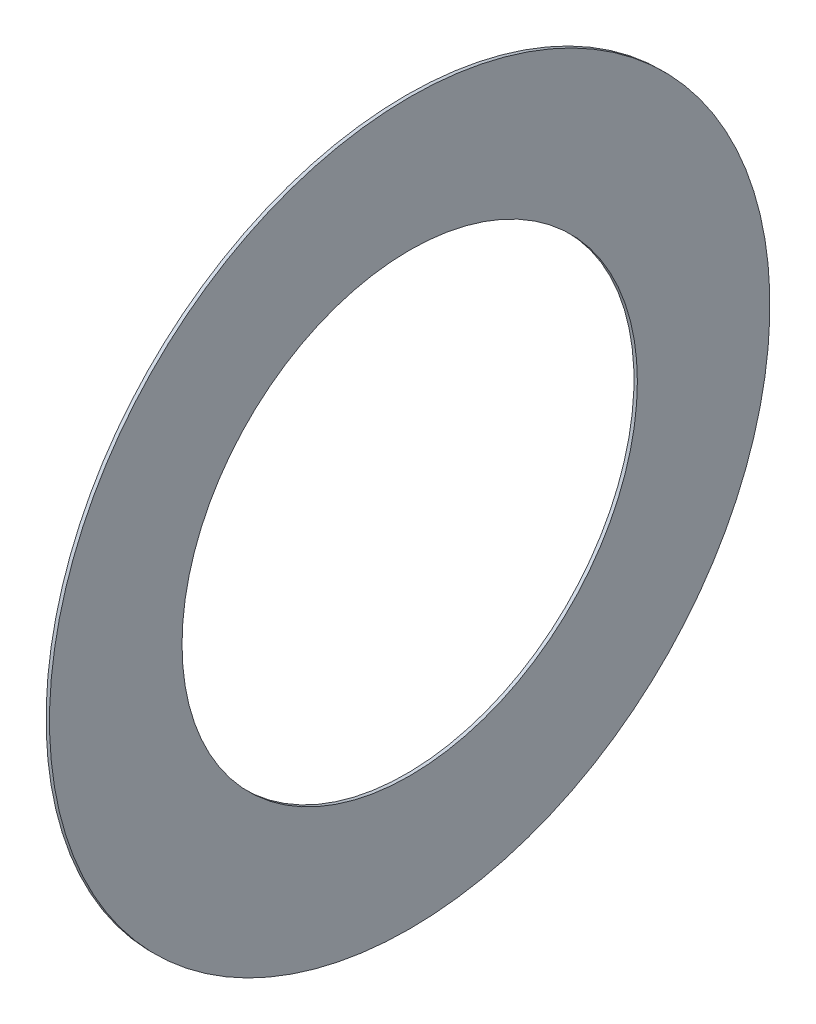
ISO-10303-21;
HEADER;
FILE_DESCRIPTION(('STEP AP214'),'2;1');
FILE_NAME('part.step','',(''),(''),'','','');
FILE_SCHEMA(('AUTOMOTIVE_DESIGN { 1 0 10303 214 1 1 1 1 }'));
ENDSEC;
DATA;
#1=APPLICATION_CONTEXT('core data for automotive mechanical design processes');
#2=APPLICATION_PROTOCOL_DEFINITION('international standard','automotive_design',2000,#1);
#3=PRODUCT_CONTEXT('',#1,'mechanical');
#4=PRODUCT('Part','Part','',(#3));
#5=PRODUCT_RELATED_PRODUCT_CATEGORY('part','',(#4));
#6=PRODUCT_DEFINITION_FORMATION('','',#4);
#7=PRODUCT_DEFINITION_CONTEXT('part definition',#1,'design');
#8=PRODUCT_DEFINITION('design','',#6,#7);
#9=PRODUCT_DEFINITION_SHAPE('','',#8);
#10=(LENGTH_UNIT() NAMED_UNIT(*) SI_UNIT(.MILLI.,.METRE.));
#11=(NAMED_UNIT(*) PLANE_ANGLE_UNIT() SI_UNIT($,.RADIAN.));
#12=(NAMED_UNIT(*) SI_UNIT($,.STERADIAN.) SOLID_ANGLE_UNIT());
#13=UNCERTAINTY_MEASURE_WITH_UNIT(LENGTH_MEASURE(1.E-05),#10,'distance_accuracy_value','');
#14=(GEOMETRIC_REPRESENTATION_CONTEXT(3) GLOBAL_UNCERTAINTY_ASSIGNED_CONTEXT((#13)) GLOBAL_UNIT_ASSIGNED_CONTEXT((#10,
#11,#12)) REPRESENTATION_CONTEXT('',''));
#15=CARTESIAN_POINT('',(0.,0.,0.));
#16=DIRECTION('',(0.,0.,1.));
#17=DIRECTION('',(1.,0.,0.));
#18=AXIS2_PLACEMENT_3D('',#15,#16,#17);
#19=CARTESIAN_POINT('',(4.85,0.,0.));
#20=DIRECTION('',(-1.,0.,0.));
#21=DIRECTION('',(0.,0.,1.));
#22=AXIS2_PLACEMENT_3D('',#19,#20,#21);
#23=PLANE('',#22);
#24=CARTESIAN_POINT('',(4.85,0.,0.));
#25=DIRECTION('',(-1.,0.,0.));
#26=DIRECTION('',(0.,0.,1.));
#27=AXIS2_PLACEMENT_3D('',#24,#25,#26);
#28=CIRCLE('',#27,10.05);
#29=CARTESIAN_POINT('',(4.85,0.,10.05));
#30=VERTEX_POINT('',#29);
#31=EDGE_CURVE('E31',#30,#30,#28,.T.);
#32=ORIENTED_EDGE('',*,*,#31,.F.);
#33=EDGE_LOOP('',(#32));
#34=FACE_BOUND('',#33,.T.);
#35=CARTESIAN_POINT('',(4.85,0.,0.));
#36=DIRECTION('',(1.,0.,0.));
#37=DIRECTION('',(0.,-1.,0.));
#38=AXIS2_PLACEMENT_3D('',#35,#36,#37);
#39=CIRCLE('',#38,15.9);
#40=CARTESIAN_POINT('',(4.85,-15.9,0.));
#41=VERTEX_POINT('',#40);
#42=EDGE_CURVE('E9',#41,#41,#39,.T.);
#43=ORIENTED_EDGE('',*,*,#42,.F.);
#44=EDGE_LOOP('',(#43));
#45=FACE_BOUND('',#44,.T.);
#46=ADVANCED_FACE('F13',(#34,#45),#23,.T.);
#47=CARTESIAN_POINT('',(5.,0.,0.));
#48=DIRECTION('',(1.,0.,0.));
#49=DIRECTION('',(0.,0.,-1.));
#50=AXIS2_PLACEMENT_3D('',#47,#48,#49);
#51=PLANE('',#50);
#52=CARTESIAN_POINT('',(5.,0.,0.));
#53=DIRECTION('',(1.,0.,0.));
#54=DIRECTION('',(0.,0.,-1.));
#55=AXIS2_PLACEMENT_3D('',#52,#53,#54);
#56=CIRCLE('',#55,10.05);
#57=CARTESIAN_POINT('',(5.,0.,-10.05));
#58=VERTEX_POINT('',#57);
#59=EDGE_CURVE('E17',#58,#58,#56,.T.);
#60=ORIENTED_EDGE('',*,*,#59,.F.);
#61=EDGE_LOOP('',(#60));
#62=FACE_BOUND('',#61,.T.);
#63=CARTESIAN_POINT('',(5.,0.,0.));
#64=DIRECTION('',(-1.,0.,0.));
#65=DIRECTION('',(0.,-1.,0.));
#66=AXIS2_PLACEMENT_3D('',#63,#64,#65);
#67=CIRCLE('',#66,15.9);
#68=CARTESIAN_POINT('',(5.,-15.9,0.));
#69=VERTEX_POINT('',#68);
#70=EDGE_CURVE('E22',#69,#69,#67,.T.);
#71=ORIENTED_EDGE('',*,*,#70,.F.);
#72=EDGE_LOOP('',(#71));
#73=FACE_BOUND('',#72,.T.);
#74=ADVANCED_FACE('F46',(#62,#73),#51,.T.);
#75=CARTESIAN_POINT('',(5.,0.,0.));
#76=DIRECTION('',(-1.,0.,0.));
#77=DIRECTION('',(0.,-1.,0.));
#78=AXIS2_PLACEMENT_3D('',#75,#76,#77);
#79=CYLINDRICAL_SURFACE('',#78,15.9);
#80=ORIENTED_EDGE('',*,*,#42,.T.);
#81=EDGE_LOOP('',(#80));
#82=FACE_BOUND('',#81,.T.);
#83=ORIENTED_EDGE('',*,*,#70,.T.);
#84=EDGE_LOOP('',(#83));
#85=FACE_BOUND('',#84,.T.);
#86=ADVANCED_FACE('F15',(#82,#85),#79,.T.);
#87=CARTESIAN_POINT('',(6.,0.,0.));
#88=DIRECTION('',(-1.,0.,0.));
#89=DIRECTION('',(0.,-1.,0.));
#90=AXIS2_PLACEMENT_3D('',#87,#88,#89);
#91=CYLINDRICAL_SURFACE('',#90,10.05);
#92=ORIENTED_EDGE('',*,*,#31,.T.);
#93=EDGE_LOOP('',(#92));
#94=FACE_BOUND('',#93,.T.);
#95=ORIENTED_EDGE('',*,*,#59,.T.);
#96=EDGE_LOOP('',(#95));
#97=FACE_BOUND('',#96,.T.);
#98=ADVANCED_FACE('F44',(#94,#97),#91,.F.);
#99=CLOSED_SHELL('',(#46,#74,#86,#98));
#100=MANIFOLD_SOLID_BREP('B1',#99);
#101=ADVANCED_BREP_SHAPE_REPRESENTATION('',(#18,#100),#14);
#102=SHAPE_DEFINITION_REPRESENTATION(#9,#101);
ENDSEC;
END-ISO-10303-21;
